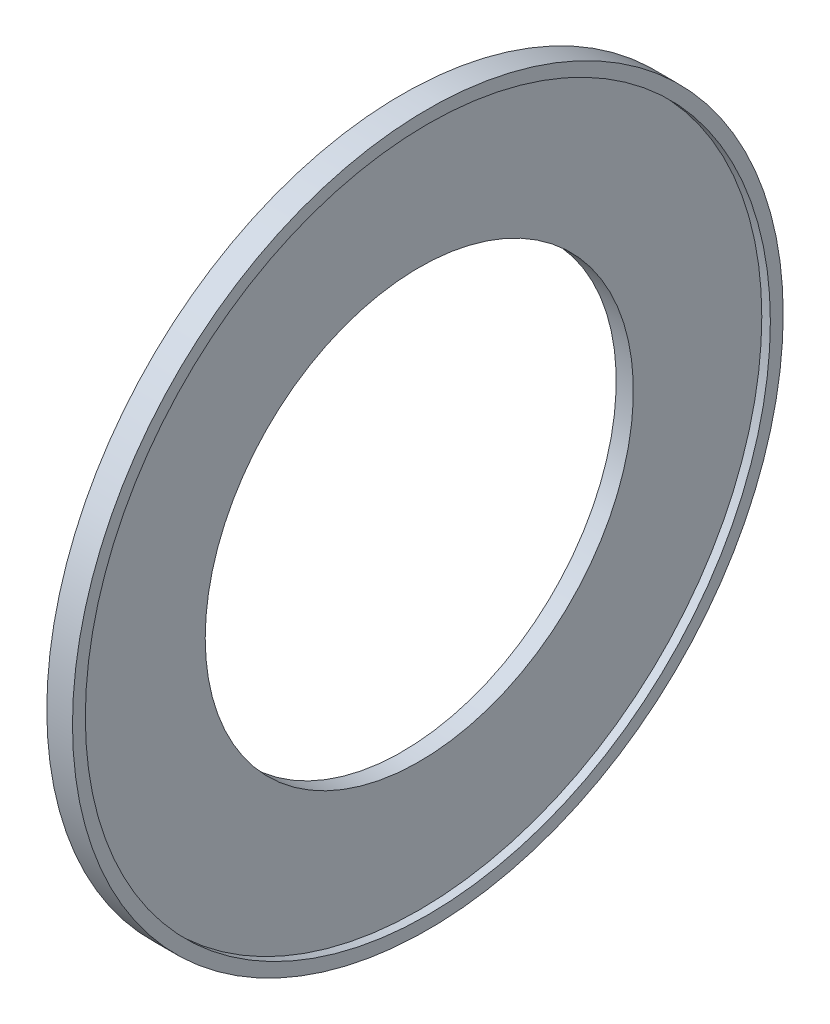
ISO-10303-21;
HEADER;
FILE_DESCRIPTION(('STEP AP214'),'2;1');
FILE_NAME('part.step','',(''),(''),'','','');
FILE_SCHEMA(('AUTOMOTIVE_DESIGN { 1 0 10303 214 1 1 1 1 }'));
ENDSEC;
DATA;
#1=APPLICATION_CONTEXT('core data for automotive mechanical design processes');
#2=APPLICATION_PROTOCOL_DEFINITION('international standard','automotive_design',2000,#1);
#3=PRODUCT_CONTEXT('',#1,'mechanical');
#4=PRODUCT('Part','Part','',(#3));
#5=PRODUCT_RELATED_PRODUCT_CATEGORY('part','',(#4));
#6=PRODUCT_DEFINITION_FORMATION('','',#4);
#7=PRODUCT_DEFINITION_CONTEXT('part definition',#1,'design');
#8=PRODUCT_DEFINITION('design','',#6,#7);
#9=PRODUCT_DEFINITION_SHAPE('','',#8);
#10=(LENGTH_UNIT() NAMED_UNIT(*) SI_UNIT(.MILLI.,.METRE.));
#11=(NAMED_UNIT(*) PLANE_ANGLE_UNIT() SI_UNIT($,.RADIAN.));
#12=(NAMED_UNIT(*) SI_UNIT($,.STERADIAN.) SOLID_ANGLE_UNIT());
#13=UNCERTAINTY_MEASURE_WITH_UNIT(LENGTH_MEASURE(1.E-05),#10,'distance_accuracy_value','');
#14=(GEOMETRIC_REPRESENTATION_CONTEXT(3) GLOBAL_UNCERTAINTY_ASSIGNED_CONTEXT((#13)) GLOBAL_UNIT_ASSIGNED_CONTEXT((#10,
#11,#12)) REPRESENTATION_CONTEXT('',''));
#15=CARTESIAN_POINT('',(0.,0.,0.));
#16=DIRECTION('',(0.,0.,1.));
#17=DIRECTION('',(1.,0.,0.));
#18=AXIS2_PLACEMENT_3D('',#15,#16,#17);
#19=CARTESIAN_POINT('',(-11.,0.,0.));
#20=DIRECTION('',(-1.,0.,0.));
#21=DIRECTION('',(0.,0.,1.));
#22=AXIS2_PLACEMENT_3D('',#19,#20,#21);
#23=CYLINDRICAL_SURFACE('',#22,20.75);
#24=CARTESIAN_POINT('',(0.,0.,0.));
#25=DIRECTION('',(-1.,0.,0.));
#26=DIRECTION('',(0.,0.,1.));
#27=AXIS2_PLACEMENT_3D('',#24,#25,#26);
#28=CIRCLE('',#27,20.75);
#29=CARTESIAN_POINT('',(0.,0.,20.75));
#30=VERTEX_POINT('',#29);
#31=EDGE_CURVE('E10',#30,#30,#28,.T.);
#32=ORIENTED_EDGE('',*,*,#31,.F.);
#33=EDGE_LOOP('',(#32));
#34=FACE_BOUND('',#33,.T.);
#35=CARTESIAN_POINT('',(1.5,0.,0.));
#36=DIRECTION('',(-1.,0.,0.));
#37=DIRECTION('',(0.,0.,1.));
#38=AXIS2_PLACEMENT_3D('',#35,#36,#37);
#39=CIRCLE('',#38,20.75);
#40=CARTESIAN_POINT('',(1.5,0.,20.75));
#41=VERTEX_POINT('',#40);
#42=EDGE_CURVE('E370',#41,#41,#39,.T.);
#43=ORIENTED_EDGE('',*,*,#42,.T.);
#44=EDGE_LOOP('',(#43));
#45=FACE_BOUND('',#44,.T.);
#46=ADVANCED_FACE('F348',(#34,#45),#23,.T.);
#47=CARTESIAN_POINT('',(0.,12.5,0.));
#48=DIRECTION('',(1.,0.,0.));
#49=DIRECTION('',(0.,0.,-1.));
#50=AXIS2_PLACEMENT_3D('',#47,#48,#49);
#51=PLANE('',#50);
#52=CARTESIAN_POINT('',(0.,0.,0.));
#53=DIRECTION('',(-1.,0.,0.));
#54=DIRECTION('',(0.,0.,1.));
#55=AXIS2_PLACEMENT_3D('',#52,#53,#54);
#56=CIRCLE('',#55,12.5);
#57=CARTESIAN_POINT('',(0.,0.,12.5));
#58=VERTEX_POINT('',#57);
#59=EDGE_CURVE('E354',#58,#58,#56,.T.);
#60=ORIENTED_EDGE('',*,*,#59,.F.);
#61=EDGE_LOOP('',(#60));
#62=FACE_BOUND('',#61,.T.);
#63=ORIENTED_EDGE('',*,*,#31,.T.);
#64=EDGE_LOOP('',(#63));
#65=FACE_BOUND('',#64,.T.);
#66=ADVANCED_FACE('F395',(#62,#65),#51,.F.);
#67=CARTESIAN_POINT('',(-11.,0.,0.));
#68=DIRECTION('',(-1.,0.,0.));
#69=DIRECTION('',(0.,0.,1.));
#70=AXIS2_PLACEMENT_3D('',#67,#68,#69);
#71=CYLINDRICAL_SURFACE('',#70,12.5);
#72=CARTESIAN_POINT('',(1.,0.,0.));
#73=DIRECTION('',(-1.,0.,0.));
#74=DIRECTION('',(0.,0.,1.));
#75=AXIS2_PLACEMENT_3D('',#72,#73,#74);
#76=CIRCLE('',#75,12.5);
#77=CARTESIAN_POINT('',(1.,0.,12.5));
#78=VERTEX_POINT('',#77);
#79=EDGE_CURVE('E358',#78,#78,#76,.T.);
#80=ORIENTED_EDGE('',*,*,#79,.F.);
#81=EDGE_LOOP('',(#80));
#82=FACE_BOUND('',#81,.T.);
#83=ORIENTED_EDGE('',*,*,#59,.T.);
#84=EDGE_LOOP('',(#83));
#85=FACE_BOUND('',#84,.T.);
#86=ADVANCED_FACE('F390',(#82,#85),#71,.F.);
#87=CARTESIAN_POINT('',(1.,20.,0.));
#88=DIRECTION('',(-1.,0.,0.));
#89=DIRECTION('',(0.,0.,1.));
#90=AXIS2_PLACEMENT_3D('',#87,#88,#89);
#91=PLANE('',#90);
#92=CARTESIAN_POINT('',(1.,0.,0.));
#93=DIRECTION('',(-1.,0.,0.));
#94=DIRECTION('',(0.,0.,1.));
#95=AXIS2_PLACEMENT_3D('',#92,#93,#94);
#96=CIRCLE('',#95,20.);
#97=CARTESIAN_POINT('',(1.,0.,20.));
#98=VERTEX_POINT('',#97);
#99=EDGE_CURVE('E362',#98,#98,#96,.T.);
#100=ORIENTED_EDGE('',*,*,#99,.F.);
#101=EDGE_LOOP('',(#100));
#102=FACE_BOUND('',#101,.T.);
#103=ORIENTED_EDGE('',*,*,#79,.T.);
#104=EDGE_LOOP('',(#103));
#105=FACE_BOUND('',#104,.T.);
#106=ADVANCED_FACE('F384',(#102,#105),#91,.F.);
#107=CARTESIAN_POINT('',(-11.,0.,0.));
#108=DIRECTION('',(-1.,0.,0.));
#109=DIRECTION('',(0.,0.,1.));
#110=AXIS2_PLACEMENT_3D('',#107,#108,#109);
#111=CYLINDRICAL_SURFACE('',#110,20.);
#112=CARTESIAN_POINT('',(1.5,0.,0.));
#113=DIRECTION('',(-1.,0.,0.));
#114=DIRECTION('',(0.,0.,1.));
#115=AXIS2_PLACEMENT_3D('',#112,#113,#114);
#116=CIRCLE('',#115,20.);
#117=CARTESIAN_POINT('',(1.5,0.,20.));
#118=VERTEX_POINT('',#117);
#119=EDGE_CURVE('E367',#118,#118,#116,.T.);
#120=ORIENTED_EDGE('',*,*,#119,.F.);
#121=EDGE_LOOP('',(#120));
#122=FACE_BOUND('',#121,.T.);
#123=ORIENTED_EDGE('',*,*,#99,.T.);
#124=EDGE_LOOP('',(#123));
#125=FACE_BOUND('',#124,.T.);
#126=ADVANCED_FACE('F378',(#122,#125),#111,.F.);
#127=CARTESIAN_POINT('',(1.5,20.75,0.));
#128=DIRECTION('',(-1.,0.,0.));
#129=DIRECTION('',(0.,0.,1.));
#130=AXIS2_PLACEMENT_3D('',#127,#128,#129);
#131=PLANE('',#130);
#132=ORIENTED_EDGE('',*,*,#42,.F.);
#133=EDGE_LOOP('',(#132));
#134=FACE_BOUND('',#133,.T.);
#135=ORIENTED_EDGE('',*,*,#119,.T.);
#136=EDGE_LOOP('',(#135));
#137=FACE_BOUND('',#136,.T.);
#138=ADVANCED_FACE('F375',(#134,#137),#131,.F.);
#139=CLOSED_SHELL('',(#46,#66,#86,#106,#126,#138));
#140=MANIFOLD_SOLID_BREP('B2',#139);
#141=ADVANCED_BREP_SHAPE_REPRESENTATION('',(#18,#140),#14);
#142=SHAPE_DEFINITION_REPRESENTATION(#9,#141);
ENDSEC;
END-ISO-10303-21;
